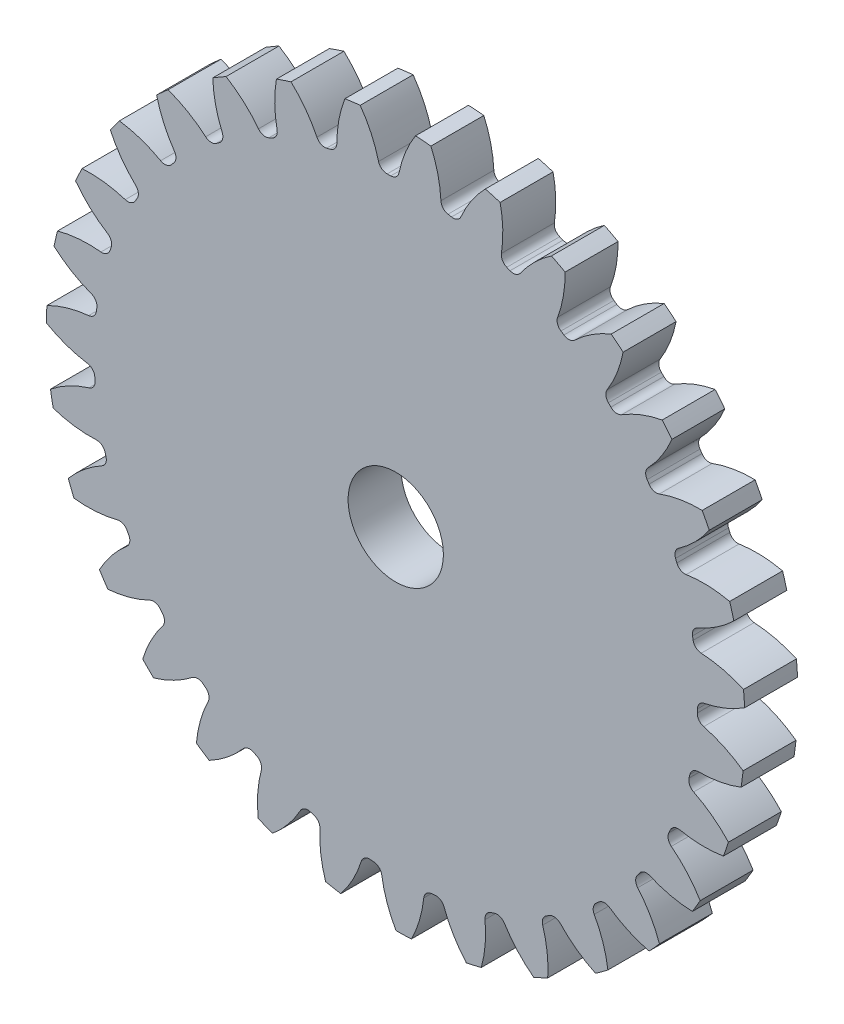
from build123d import *

# Parameters (mm, degrees)
SKETCH3_R         = 838.2
GEARBODY_DEPTH    = 127
TOOTHCUT_DEPTH    = 1193.177620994
CIRPATTERN1_COUNT = 31
BOREDIA_R         = 114.3
BORE_DEPTH        = 12700


with BuildPart() as part:
    # Sketch3 → gearBody (new body)
    with BuildSketch(Plane.XY):
        Circle(SKETCH3_R)
    extrude(amount=GEARBODY_DEPTH)

    # Sketch2 → toothCut (cut, through all)
    with BuildSketch(Plane.XY):
        with BuildLine():
            ThreePointArc((723.483089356, -24.564800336), (723.615768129, -20.283740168), (723.723114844, -16.001969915))
            ThreePointArc((723.723114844, -16.001969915), (728.531484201, -3.197344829), (740.281640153, 3.80356044))
            ThreePointArc((740.281640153, 3.80356044), (791.105980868, 19.163418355), (838.2, 43.682639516))
            ThreePointArc((838.2, 43.682639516), (839.007927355, -23.518308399), (834.436794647, -90.568475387))
            ThreePointArc((834.436794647, -90.568475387), (788.790246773, -63.44963486), (738.906144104, -45.266809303))
            ThreePointArc((738.906144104, -45.266809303), (727.566616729, -37.618674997), (723.483089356, -24.564800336))
        make_face()
    toothcut = extrude(amount=TOOTHCUT_DEPTH, mode=Mode.SUBTRACT)

    # CirPattern1: toothCut ×31 about axis
    cirpattern1_axis = Axis((0, 0, 0), (0, 0, 1))
    for i in range(1, CIRPATTERN1_COUNT):
        add(toothcut.rotate(cirpattern1_axis, i * 360 / CIRPATTERN1_COUNT), mode=Mode.SUBTRACT)

    # boreDia → bore (cut, symmetric)
    with BuildSketch(Plane.XY):
        Circle(BOREDIA_R)
    extrude(amount=BORE_DEPTH, both=True, mode=Mode.SUBTRACT)


solid = part.part
